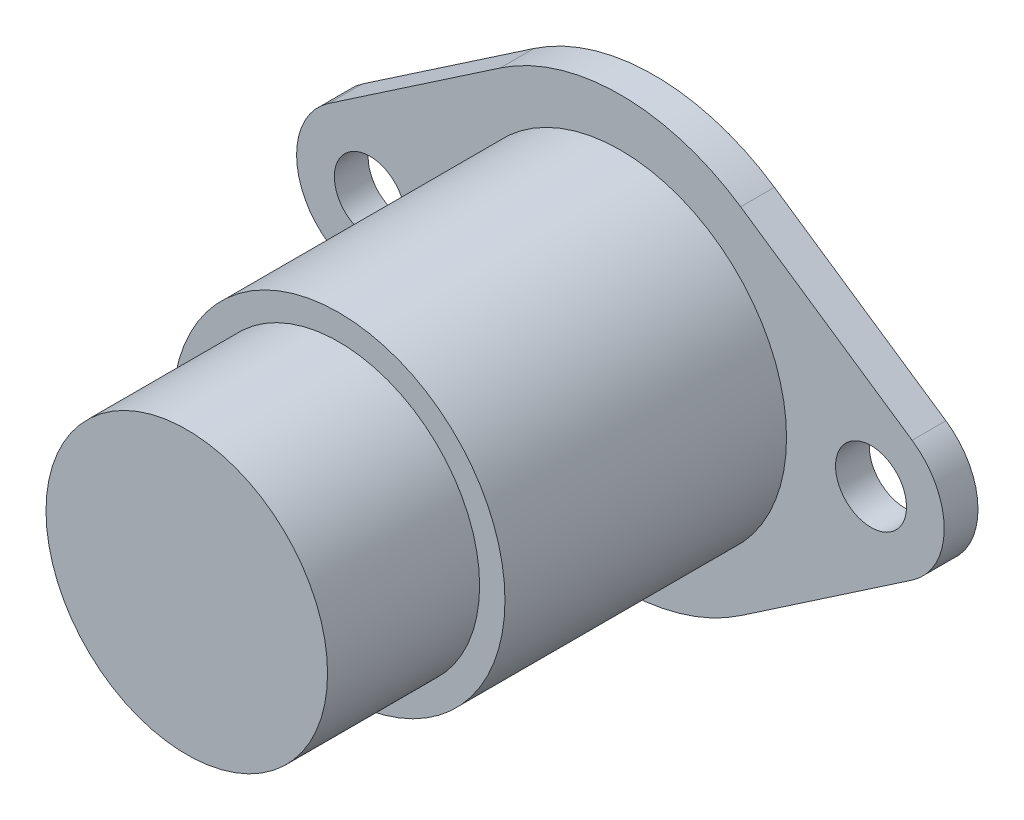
ISO-10303-21;
HEADER;
FILE_DESCRIPTION(('STEP AP214'),'2;1');
FILE_NAME('part.step','',(''),(''),'','','');
FILE_SCHEMA(('AUTOMOTIVE_DESIGN { 1 0 10303 214 1 1 1 1 }'));
ENDSEC;
DATA;
#1=APPLICATION_CONTEXT('core data for automotive mechanical design processes');
#2=APPLICATION_PROTOCOL_DEFINITION('international standard','automotive_design',2000,#1);
#3=PRODUCT_CONTEXT('',#1,'mechanical');
#4=PRODUCT('Part','Part','',(#3));
#5=PRODUCT_RELATED_PRODUCT_CATEGORY('part','',(#4));
#6=PRODUCT_DEFINITION_FORMATION('','',#4);
#7=PRODUCT_DEFINITION_CONTEXT('part definition',#1,'design');
#8=PRODUCT_DEFINITION('design','',#6,#7);
#9=PRODUCT_DEFINITION_SHAPE('','',#8);
#10=(LENGTH_UNIT() NAMED_UNIT(*) SI_UNIT(.MILLI.,.METRE.));
#11=(NAMED_UNIT(*) PLANE_ANGLE_UNIT() SI_UNIT($,.RADIAN.));
#12=(NAMED_UNIT(*) SI_UNIT($,.STERADIAN.) SOLID_ANGLE_UNIT());
#13=UNCERTAINTY_MEASURE_WITH_UNIT(LENGTH_MEASURE(1.E-05),#10,'distance_accuracy_value','');
#14=(GEOMETRIC_REPRESENTATION_CONTEXT(3) GLOBAL_UNCERTAINTY_ASSIGNED_CONTEXT((#13)) GLOBAL_UNIT_ASSIGNED_CONTEXT((#10,
#11,#12)) REPRESENTATION_CONTEXT('',''));
#15=CARTESIAN_POINT('',(0.,0.,0.));
#16=DIRECTION('',(0.,0.,1.));
#17=DIRECTION('',(1.,0.,0.));
#18=AXIS2_PLACEMENT_3D('',#15,#16,#17);
#19=CARTESIAN_POINT('',(0.,0.,21.082));
#20=DIRECTION('',(0.,0.,-1.));
#21=DIRECTION('',(-1.,0.,0.));
#22=AXIS2_PLACEMENT_3D('',#19,#20,#21);
#23=CYLINDRICAL_SURFACE('',#22,6.35);
#24=CARTESIAN_POINT('',(0.,0.,21.082));
#25=DIRECTION('',(0.,0.,1.));
#26=DIRECTION('',(1.,0.,0.));
#27=AXIS2_PLACEMENT_3D('',#24,#25,#26);
#28=CIRCLE('',#27,6.35);
#29=CARTESIAN_POINT('',(6.35,0.,21.082));
#30=VERTEX_POINT('',#29);
#31=EDGE_CURVE('E11',#30,#30,#28,.T.);
#32=ORIENTED_EDGE('',*,*,#31,.F.);
#33=EDGE_LOOP('',(#32));
#34=FACE_BOUND('',#33,.T.);
#35=CARTESIAN_POINT('',(0.,0.,14.224));
#36=DIRECTION('',(0.,0.,1.));
#37=DIRECTION('',(1.,0.,0.));
#38=AXIS2_PLACEMENT_3D('',#35,#36,#37);
#39=CIRCLE('',#38,6.35);
#40=CARTESIAN_POINT('',(6.35,0.,14.224));
#41=VERTEX_POINT('',#40);
#42=EDGE_CURVE('E43',#41,#41,#39,.T.);
#43=ORIENTED_EDGE('',*,*,#42,.T.);
#44=EDGE_LOOP('',(#43));
#45=FACE_BOUND('',#44,.T.);
#46=ADVANCED_FACE('F40',(#34,#45),#23,.T.);
#47=CARTESIAN_POINT('',(0.,0.,21.082));
#48=DIRECTION('',(0.,0.,1.));
#49=DIRECTION('',(1.,0.,0.));
#50=AXIS2_PLACEMENT_3D('',#47,#48,#49);
#51=PLANE('',#50);
#52=ORIENTED_EDGE('',*,*,#31,.T.);
#53=EDGE_LOOP('',(#52));
#54=FACE_BOUND('',#53,.T.);
#55=ADVANCED_FACE('F55',(#54),#51,.T.);
#56=CARTESIAN_POINT('',(0.,0.,14.224));
#57=DIRECTION('',(0.,0.,1.));
#58=DIRECTION('',(1.,0.,0.));
#59=AXIS2_PLACEMENT_3D('',#56,#57,#58);
#60=PLANE('',#59);
#61=ORIENTED_EDGE('',*,*,#42,.F.);
#62=EDGE_LOOP('',(#61));
#63=FACE_BOUND('',#62,.T.);
#64=ADVANCED_FACE('F53',(#63),#60,.F.);
#65=CLOSED_SHELL('',(#46,#55,#64));
#66=MANIFOLD_SOLID_BREP('B2',#65);
#67=CARTESIAN_POINT('',(0.,0.,0.254000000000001));
#68=DIRECTION('',(0.,0.,1.));
#69=DIRECTION('',(1.,0.,0.));
#70=AXIS2_PLACEMENT_3D('',#67,#68,#69);
#71=CYLINDRICAL_SURFACE('',#70,5.969);
#72=CARTESIAN_POINT('',(0.,0.,0.254000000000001));
#73=DIRECTION('',(0.,0.,-1.));
#74=DIRECTION('',(-1.,0.,0.));
#75=AXIS2_PLACEMENT_3D('',#72,#73,#74);
#76=CIRCLE('',#75,5.969);
#77=CARTESIAN_POINT('',(-5.969,0.,0.254000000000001));
#78=VERTEX_POINT('',#77);
#79=EDGE_CURVE('E39',#78,#78,#76,.T.);
#80=ORIENTED_EDGE('',*,*,#79,.F.);
#81=EDGE_LOOP('',(#80));
#82=FACE_BOUND('',#81,.T.);
#83=CARTESIAN_POINT('',(0.,0.,10.16));
#84=DIRECTION('',(0.,0.,-1.));
#85=DIRECTION('',(-1.,0.,0.));
#86=AXIS2_PLACEMENT_3D('',#83,#84,#85);
#87=CIRCLE('',#86,5.969);
#88=CARTESIAN_POINT('',(-5.969,0.,10.16));
#89=VERTEX_POINT('',#88);
#90=EDGE_CURVE('E92',#89,#89,#87,.T.);
#91=ORIENTED_EDGE('',*,*,#90,.T.);
#92=EDGE_LOOP('',(#91));
#93=FACE_BOUND('',#92,.T.);
#94=ADVANCED_FACE('F89',(#82,#93),#71,.T.);
#95=CARTESIAN_POINT('',(0.,0.,0.254000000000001));
#96=DIRECTION('',(0.,0.,-1.));
#97=DIRECTION('',(-1.,0.,0.));
#98=AXIS2_PLACEMENT_3D('',#95,#96,#97);
#99=PLANE('',#98);
#100=ORIENTED_EDGE('',*,*,#79,.T.);
#101=EDGE_LOOP('',(#100));
#102=FACE_BOUND('',#101,.T.);
#103=ADVANCED_FACE('F104',(#102),#99,.T.);
#104=CARTESIAN_POINT('',(0.,0.,10.16));
#105=DIRECTION('',(0.,0.,-1.));
#106=DIRECTION('',(-1.,0.,0.));
#107=AXIS2_PLACEMENT_3D('',#104,#105,#106);
#108=PLANE('',#107);
#109=ORIENTED_EDGE('',*,*,#90,.F.);
#110=EDGE_LOOP('',(#109));
#111=FACE_BOUND('',#110,.T.);
#112=ADVANCED_FACE('F102',(#111),#108,.F.);
#113=CLOSED_SHELL('',(#94,#103,#112));
#114=MANIFOLD_SOLID_BREP('B6',#113);
#115=CARTESIAN_POINT('',(0.,0.,1.524));
#116=DIRECTION('',(0.,0.,-1.));
#117=DIRECTION('',(-1.,0.,0.));
#118=AXIS2_PLACEMENT_3D('',#115,#116,#117);
#119=PLANE('',#118);
#120=CARTESIAN_POINT('',(11.303,0.,1.524));
#121=DIRECTION('',(0.,0.,1.));
#122=DIRECTION('',(1.,0.,0.));
#123=AXIS2_PLACEMENT_3D('',#120,#121,#122);
#124=CIRCLE('',#123,1.6002);
#125=CARTESIAN_POINT('',(12.9032,0.,1.524));
#126=VERTEX_POINT('',#125);
#127=EDGE_CURVE('E290',#126,#126,#124,.T.);
#128=ORIENTED_EDGE('',*,*,#127,.F.);
#129=EDGE_LOOP('',(#128));
#130=FACE_BOUND('',#129,.T.);
#131=CARTESIAN_POINT('',(-11.303,0.,1.524));
#132=DIRECTION('',(0.,0.,1.));
#133=DIRECTION('',(1.,0.,0.));
#134=AXIS2_PLACEMENT_3D('',#131,#132,#133);
#135=CIRCLE('',#134,1.6002);
#136=CARTESIAN_POINT('',(-9.7028,0.,1.524));
#137=VERTEX_POINT('',#136);
#138=EDGE_CURVE('E284',#137,#137,#135,.T.);
#139=ORIENTED_EDGE('',*,*,#138,.F.);
#140=EDGE_LOOP('',(#139));
#141=FACE_BOUND('',#140,.T.);
#142=CARTESIAN_POINT('',(0.,0.,1.524));
#143=DIRECTION('',(0.,0.,1.));
#144=DIRECTION('',(-1.,0.,0.));
#145=AXIS2_PLACEMENT_3D('',#142,#143,#144);
#146=CIRCLE('',#145,9.652);
#147=CARTESIAN_POINT('',(5.42247191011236,7.98485456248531,1.524));
#148=VERTEX_POINT('',#147);
#149=CARTESIAN_POINT('',(-5.42247191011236,7.9848545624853,1.524));
#150=VERTEX_POINT('',#149);
#151=EDGE_CURVE('E242',#148,#150,#146,.T.);
#152=ORIENTED_EDGE('',*,*,#151,.T.);
#153=DIRECTION('',(-0.827274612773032,-0.561797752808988,0.));
#154=VECTOR('',#153,1.);
#155=CARTESIAN_POINT('',(-5.42247191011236,7.9848545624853,1.524));
#156=LINE('',#155,#154);
#157=CARTESIAN_POINT('',(-13.1580561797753,2.73166077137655,1.524));
#158=VERTEX_POINT('',#157);
#159=EDGE_CURVE('E190',#150,#158,#156,.T.);
#160=ORIENTED_EDGE('',*,*,#159,.T.);
#161=CARTESIAN_POINT('',(-11.303,0.,1.524));
#162=DIRECTION('',(0.,0.,1.));
#163=DIRECTION('',(1.,0.,0.));
#164=AXIS2_PLACEMENT_3D('',#161,#162,#163);
#165=CIRCLE('',#164,3.302);
#166=CARTESIAN_POINT('',(-13.1580561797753,-2.73166077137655,1.524));
#167=VERTEX_POINT('',#166);
#168=EDGE_CURVE('E273',#158,#167,#165,.T.);
#169=ORIENTED_EDGE('',*,*,#168,.T.);
#170=DIRECTION('',(0.827274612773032,-0.561797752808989,0.));
#171=VECTOR('',#170,1.);
#172=CARTESIAN_POINT('',(-5.42247191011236,-7.98485456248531,1.524));
#173=LINE('',#172,#171);
#174=CARTESIAN_POINT('',(-5.42247191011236,-7.98485456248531,1.524));
#175=VERTEX_POINT('',#174);
#176=EDGE_CURVE('E272',#167,#175,#173,.T.);
#177=ORIENTED_EDGE('',*,*,#176,.T.);
#178=CARTESIAN_POINT('',(0.,0.,1.524));
#179=DIRECTION('',(0.,0.,1.));
#180=DIRECTION('',(-1.,0.,0.));
#181=AXIS2_PLACEMENT_3D('',#178,#179,#180);
#182=CIRCLE('',#181,9.652);
#183=CARTESIAN_POINT('',(5.42247191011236,-7.9848545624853,1.524));
#184=VERTEX_POINT('',#183);
#185=EDGE_CURVE('E209',#175,#184,#182,.T.);
#186=ORIENTED_EDGE('',*,*,#185,.T.);
#187=DIRECTION('',(0.827274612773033,0.561797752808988,0.));
#188=VECTOR('',#187,1.);
#189=CARTESIAN_POINT('',(5.42247191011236,-7.9848545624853,1.524));
#190=LINE('',#189,#188);
#191=CARTESIAN_POINT('',(13.1580561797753,-2.73166077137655,1.524));
#192=VERTEX_POINT('',#191);
#193=EDGE_CURVE('E203',#184,#192,#190,.T.);
#194=ORIENTED_EDGE('',*,*,#193,.T.);
#195=CARTESIAN_POINT('',(11.303,0.,1.524));
#196=DIRECTION('',(0.,0.,1.));
#197=DIRECTION('',(1.,0.,0.));
#198=AXIS2_PLACEMENT_3D('',#195,#196,#197);
#199=CIRCLE('',#198,3.302);
#200=CARTESIAN_POINT('',(13.1580561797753,2.73166077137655,1.524));
#201=VERTEX_POINT('',#200);
#202=EDGE_CURVE('E207',#192,#201,#199,.T.);
#203=ORIENTED_EDGE('',*,*,#202,.T.);
#204=DIRECTION('',(-0.827274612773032,0.561797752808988,0.));
#205=VECTOR('',#204,1.);
#206=CARTESIAN_POINT('',(5.42247191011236,7.98485456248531,1.524));
#207=LINE('',#206,#205);
#208=EDGE_CURVE('E146',#201,#148,#207,.T.);
#209=ORIENTED_EDGE('',*,*,#208,.T.);
#210=EDGE_LOOP('',(#152,#160,#169,#177,#186,#194,#203,#209));
#211=FACE_BOUND('',#210,.T.);
#212=CARTESIAN_POINT('',(0.,0.,1.524));
#213=DIRECTION('',(0.,0.,-1.));
#214=DIRECTION('',(-1.,0.,0.));
#215=AXIS2_PLACEMENT_3D('',#212,#213,#214);
#216=CIRCLE('',#215,7.493);
#217=CARTESIAN_POINT('',(-7.493,0.,1.524));
#218=VERTEX_POINT('',#217);
#219=EDGE_CURVE('E87',#218,#218,#216,.F.);
#220=ORIENTED_EDGE('',*,*,#219,.F.);
#221=EDGE_LOOP('',(#220));
#222=FACE_BOUND('',#221,.T.);
#223=ADVANCED_FACE('F129',(#130,#141,#211,#222),#119,.F.);
#224=CARTESIAN_POINT('',(0.,0.,1.524));
#225=DIRECTION('',(0.,0.,-1.));
#226=DIRECTION('',(-1.,0.,0.));
#227=AXIS2_PLACEMENT_3D('',#224,#225,#226);
#228=CYLINDRICAL_SURFACE('',#227,9.652);
#229=CARTESIAN_POINT('',(0.,0.,0.));
#230=DIRECTION('',(0.,0.,1.));
#231=DIRECTION('',(-1.,0.,0.));
#232=AXIS2_PLACEMENT_3D('',#229,#230,#231);
#233=CIRCLE('',#232,9.652);
#234=CARTESIAN_POINT('',(5.42247191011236,7.98485456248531,0.));
#235=VERTEX_POINT('',#234);
#236=CARTESIAN_POINT('',(-5.42247191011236,7.9848545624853,0.));
#237=VERTEX_POINT('',#236);
#238=EDGE_CURVE('E227',#235,#237,#233,.T.);
#239=ORIENTED_EDGE('',*,*,#238,.T.);
#240=DIRECTION('',(0.,0.,-1.));
#241=VECTOR('',#240,1.);
#242=CARTESIAN_POINT('',(-5.42247191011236,7.9848545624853,1.524));
#243=LINE('',#242,#241);
#244=EDGE_CURVE('E138',#150,#237,#243,.T.);
#245=ORIENTED_EDGE('',*,*,#244,.F.);
#246=ORIENTED_EDGE('',*,*,#151,.F.);
#247=DIRECTION('',(0.,0.,-1.));
#248=VECTOR('',#247,1.);
#249=CARTESIAN_POINT('',(5.42247191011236,7.98485456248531,1.524));
#250=LINE('',#249,#248);
#251=EDGE_CURVE('E223',#148,#235,#250,.T.);
#252=ORIENTED_EDGE('',*,*,#251,.T.);
#253=EDGE_LOOP('',(#239,#245,#246,#252));
#254=FACE_BOUND('',#253,.T.);
#255=ADVANCED_FACE('F131',(#254),#228,.T.);
#256=CARTESIAN_POINT('',(-5.42247191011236,7.9848545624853,1.524));
#257=DIRECTION('',(0.561797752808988,-0.827274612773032,0.));
#258=DIRECTION('',(0.827274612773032,0.561797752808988,0.));
#259=AXIS2_PLACEMENT_3D('',#256,#257,#258);
#260=PLANE('',#259);
#261=DIRECTION('',(-0.827274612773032,-0.561797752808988,0.));
#262=VECTOR('',#261,1.);
#263=CARTESIAN_POINT('',(-5.42247191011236,7.9848545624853,0.));
#264=LINE('',#263,#262);
#265=CARTESIAN_POINT('',(-13.1580561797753,2.73166077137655,0.));
#266=VERTEX_POINT('',#265);
#267=EDGE_CURVE('E230',#237,#266,#264,.T.);
#268=ORIENTED_EDGE('',*,*,#267,.T.);
#269=DIRECTION('',(0.,0.,-1.));
#270=VECTOR('',#269,1.);
#271=CARTESIAN_POINT('',(-13.1580561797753,2.73166077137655,1.524));
#272=LINE('',#271,#270);
#273=EDGE_CURVE('E252',#158,#266,#272,.T.);
#274=ORIENTED_EDGE('',*,*,#273,.F.);
#275=ORIENTED_EDGE('',*,*,#159,.F.);
#276=ORIENTED_EDGE('',*,*,#244,.T.);
#277=EDGE_LOOP('',(#268,#274,#275,#276));
#278=FACE_BOUND('',#277,.T.);
#279=ADVANCED_FACE('F255',(#278),#260,.F.);
#280=CARTESIAN_POINT('',(-11.303,0.,1.524));
#281=DIRECTION('',(0.,0.,-1.));
#282=DIRECTION('',(-1.,0.,0.));
#283=AXIS2_PLACEMENT_3D('',#280,#281,#282);
#284=CYLINDRICAL_SURFACE('',#283,3.302);
#285=CARTESIAN_POINT('',(-11.303,0.,0.));
#286=DIRECTION('',(0.,0.,1.));
#287=DIRECTION('',(1.,0.,0.));
#288=AXIS2_PLACEMENT_3D('',#285,#286,#287);
#289=CIRCLE('',#288,3.302);
#290=CARTESIAN_POINT('',(-13.1580561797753,-2.73166077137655,0.));
#291=VERTEX_POINT('',#290);
#292=EDGE_CURVE('E233',#266,#291,#289,.T.);
#293=ORIENTED_EDGE('',*,*,#292,.T.);
#294=DIRECTION('',(0.,0.,-1.));
#295=VECTOR('',#294,1.);
#296=CARTESIAN_POINT('',(-13.1580561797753,-2.73166077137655,1.524));
#297=LINE('',#296,#295);
#298=EDGE_CURVE('E249',#167,#291,#297,.T.);
#299=ORIENTED_EDGE('',*,*,#298,.F.);
#300=ORIENTED_EDGE('',*,*,#168,.F.);
#301=ORIENTED_EDGE('',*,*,#273,.T.);
#302=EDGE_LOOP('',(#293,#299,#300,#301));
#303=FACE_BOUND('',#302,.T.);
#304=ADVANCED_FACE('F266',(#303),#284,.T.);
#305=CARTESIAN_POINT('',(-5.42247191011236,-7.98485456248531,1.524));
#306=DIRECTION('',(0.561797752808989,0.827274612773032,0.));
#307=DIRECTION('',(-0.827274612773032,0.561797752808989,0.));
#308=AXIS2_PLACEMENT_3D('',#305,#306,#307);
#309=PLANE('',#308);
#310=DIRECTION('',(0.827274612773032,-0.561797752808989,0.));
#311=VECTOR('',#310,1.);
#312=CARTESIAN_POINT('',(-5.42247191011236,-7.98485456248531,0.));
#313=LINE('',#312,#311);
#314=CARTESIAN_POINT('',(-5.42247191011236,-7.98485456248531,0.));
#315=VERTEX_POINT('',#314);
#316=EDGE_CURVE('E235',#291,#315,#313,.T.);
#317=ORIENTED_EDGE('',*,*,#316,.T.);
#318=DIRECTION('',(0.,0.,-1.));
#319=VECTOR('',#318,1.);
#320=CARTESIAN_POINT('',(-5.42247191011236,-7.98485456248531,1.524));
#321=LINE('',#320,#319);
#322=EDGE_CURVE('E246',#175,#315,#321,.T.);
#323=ORIENTED_EDGE('',*,*,#322,.F.);
#324=ORIENTED_EDGE('',*,*,#176,.F.);
#325=ORIENTED_EDGE('',*,*,#298,.T.);
#326=EDGE_LOOP('',(#317,#323,#324,#325));
#327=FACE_BOUND('',#326,.T.);
#328=ADVANCED_FACE('F270',(#327),#309,.F.);
#329=CARTESIAN_POINT('',(0.,0.,1.524));
#330=DIRECTION('',(0.,0.,-1.));
#331=DIRECTION('',(-1.,0.,0.));
#332=AXIS2_PLACEMENT_3D('',#329,#330,#331);
#333=CYLINDRICAL_SURFACE('',#332,9.652);
#334=CARTESIAN_POINT('',(0.,0.,0.));
#335=DIRECTION('',(0.,0.,1.));
#336=DIRECTION('',(-1.,0.,0.));
#337=AXIS2_PLACEMENT_3D('',#334,#335,#336);
#338=CIRCLE('',#337,9.652);
#339=CARTESIAN_POINT('',(5.42247191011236,-7.9848545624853,0.));
#340=VERTEX_POINT('',#339);
#341=EDGE_CURVE('E237',#315,#340,#338,.T.);
#342=ORIENTED_EDGE('',*,*,#341,.T.);
#343=DIRECTION('',(0.,0.,-1.));
#344=VECTOR('',#343,1.);
#345=CARTESIAN_POINT('',(5.42247191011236,-7.9848545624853,1.524));
#346=LINE('',#345,#344);
#347=EDGE_CURVE('E218',#184,#340,#346,.T.);
#348=ORIENTED_EDGE('',*,*,#347,.F.);
#349=ORIENTED_EDGE('',*,*,#185,.F.);
#350=ORIENTED_EDGE('',*,*,#322,.T.);
#351=EDGE_LOOP('',(#342,#348,#349,#350));
#352=FACE_BOUND('',#351,.T.);
#353=ADVANCED_FACE('F347',(#352),#333,.T.);
#354=CARTESIAN_POINT('',(5.42247191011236,-7.9848545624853,1.524));
#355=DIRECTION('',(-0.561797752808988,0.827274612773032,0.));
#356=DIRECTION('',(-0.827274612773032,-0.561797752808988,0.));
#357=AXIS2_PLACEMENT_3D('',#354,#355,#356);
#358=PLANE('',#357);
#359=DIRECTION('',(0.827274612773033,0.561797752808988,0.));
#360=VECTOR('',#359,1.);
#361=CARTESIAN_POINT('',(5.42247191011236,-7.9848545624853,0.));
#362=LINE('',#361,#360);
#363=CARTESIAN_POINT('',(13.1580561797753,-2.73166077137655,0.));
#364=VERTEX_POINT('',#363);
#365=EDGE_CURVE('E217',#340,#364,#362,.T.);
#366=ORIENTED_EDGE('',*,*,#365,.T.);
#367=DIRECTION('',(0.,0.,-1.));
#368=VECTOR('',#367,1.);
#369=CARTESIAN_POINT('',(13.1580561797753,-2.73166077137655,1.524));
#370=LINE('',#369,#368);
#371=EDGE_CURVE('E214',#192,#364,#370,.T.);
#372=ORIENTED_EDGE('',*,*,#371,.F.);
#373=ORIENTED_EDGE('',*,*,#193,.F.);
#374=ORIENTED_EDGE('',*,*,#347,.T.);
#375=EDGE_LOOP('',(#366,#372,#373,#374));
#376=FACE_BOUND('',#375,.T.);
#377=ADVANCED_FACE('F215',(#376),#358,.F.);
#378=CARTESIAN_POINT('',(11.303,0.,1.524));
#379=DIRECTION('',(0.,0.,-1.));
#380=DIRECTION('',(-1.,0.,0.));
#381=AXIS2_PLACEMENT_3D('',#378,#379,#380);
#382=CYLINDRICAL_SURFACE('',#381,3.302);
#383=CARTESIAN_POINT('',(11.303,0.,0.));
#384=DIRECTION('',(0.,0.,1.));
#385=DIRECTION('',(1.,0.,0.));
#386=AXIS2_PLACEMENT_3D('',#383,#384,#385);
#387=CIRCLE('',#386,3.302);
#388=CARTESIAN_POINT('',(13.1580561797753,2.73166077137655,0.));
#389=VERTEX_POINT('',#388);
#390=EDGE_CURVE('E175',#364,#389,#387,.T.);
#391=ORIENTED_EDGE('',*,*,#390,.T.);
#392=DIRECTION('',(0.,0.,-1.));
#393=VECTOR('',#392,1.);
#394=CARTESIAN_POINT('',(13.1580561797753,2.73166077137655,1.524));
#395=LINE('',#394,#393);
#396=EDGE_CURVE('E219',#201,#389,#395,.T.);
#397=ORIENTED_EDGE('',*,*,#396,.F.);
#398=ORIENTED_EDGE('',*,*,#202,.F.);
#399=ORIENTED_EDGE('',*,*,#371,.T.);
#400=EDGE_LOOP('',(#391,#397,#398,#399));
#401=FACE_BOUND('',#400,.T.);
#402=ADVANCED_FACE('F221',(#401),#382,.T.);
#403=CARTESIAN_POINT('',(5.42247191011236,7.98485456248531,1.524));
#404=DIRECTION('',(-0.561797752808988,-0.827274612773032,0.));
#405=DIRECTION('',(0.827274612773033,-0.561797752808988,0.));
#406=AXIS2_PLACEMENT_3D('',#403,#404,#405);
#407=PLANE('',#406);
#408=DIRECTION('',(-0.827274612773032,0.561797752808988,0.));
#409=VECTOR('',#408,1.);
#410=CARTESIAN_POINT('',(5.42247191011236,7.98485456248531,0.));
#411=LINE('',#410,#409);
#412=EDGE_CURVE('E181',#389,#235,#411,.T.);
#413=ORIENTED_EDGE('',*,*,#412,.T.);
#414=ORIENTED_EDGE('',*,*,#251,.F.);
#415=ORIENTED_EDGE('',*,*,#208,.F.);
#416=ORIENTED_EDGE('',*,*,#396,.T.);
#417=EDGE_LOOP('',(#413,#414,#415,#416));
#418=FACE_BOUND('',#417,.T.);
#419=ADVANCED_FACE('F312',(#418),#407,.F.);
#420=CARTESIAN_POINT('',(0.,0.,0.));
#421=DIRECTION('',(0.,0.,-1.));
#422=DIRECTION('',(-1.,0.,0.));
#423=AXIS2_PLACEMENT_3D('',#420,#421,#422);
#424=PLANE('',#423);
#425=CARTESIAN_POINT('',(0.,0.,0.));
#426=DIRECTION('',(0.,0.,-1.));
#427=DIRECTION('',(-1.,0.,0.));
#428=AXIS2_PLACEMENT_3D('',#425,#426,#427);
#429=CIRCLE('',#428,6.985);
#430=CARTESIAN_POINT('',(-6.985,0.,0.));
#431=VERTEX_POINT('',#430);
#432=EDGE_CURVE('E294',#431,#431,#429,.T.);
#433=ORIENTED_EDGE('',*,*,#432,.F.);
#434=EDGE_LOOP('',(#433));
#435=FACE_BOUND('',#434,.T.);
#436=CARTESIAN_POINT('',(11.303,0.,0.));
#437=DIRECTION('',(0.,0.,-1.));
#438=DIRECTION('',(-1.,0.,0.));
#439=AXIS2_PLACEMENT_3D('',#436,#437,#438);
#440=CIRCLE('',#439,1.6002);
#441=CARTESIAN_POINT('',(9.7028,0.,0.));
#442=VERTEX_POINT('',#441);
#443=EDGE_CURVE('E287',#442,#442,#440,.F.);
#444=ORIENTED_EDGE('',*,*,#443,.T.);
#445=EDGE_LOOP('',(#444));
#446=FACE_BOUND('',#445,.T.);
#447=CARTESIAN_POINT('',(-11.303,0.,0.));
#448=DIRECTION('',(0.,0.,-1.));
#449=DIRECTION('',(-1.,0.,0.));
#450=AXIS2_PLACEMENT_3D('',#447,#448,#449);
#451=CIRCLE('',#450,1.6002);
#452=CARTESIAN_POINT('',(-12.9032,0.,0.));
#453=VERTEX_POINT('',#452);
#454=EDGE_CURVE('E281',#453,#453,#451,.F.);
#455=ORIENTED_EDGE('',*,*,#454,.T.);
#456=EDGE_LOOP('',(#455));
#457=FACE_BOUND('',#456,.T.);
#458=ORIENTED_EDGE('',*,*,#238,.F.);
#459=ORIENTED_EDGE('',*,*,#412,.F.);
#460=ORIENTED_EDGE('',*,*,#390,.F.);
#461=ORIENTED_EDGE('',*,*,#365,.F.);
#462=ORIENTED_EDGE('',*,*,#341,.F.);
#463=ORIENTED_EDGE('',*,*,#316,.F.);
#464=ORIENTED_EDGE('',*,*,#292,.F.);
#465=ORIENTED_EDGE('',*,*,#267,.F.);
#466=EDGE_LOOP('',(#458,#459,#460,#461,#462,#463,#464,#465));
#467=FACE_BOUND('',#466,.T.);
#468=ADVANCED_FACE('F260',(#435,#446,#457,#467),#424,.T.);
#469=CARTESIAN_POINT('',(0.,0.,14.224));
#470=DIRECTION('',(0.,0.,-1.));
#471=DIRECTION('',(-1.,0.,0.));
#472=AXIS2_PLACEMENT_3D('',#469,#470,#471);
#473=CYLINDRICAL_SURFACE('',#472,7.493);
#474=CARTESIAN_POINT('',(0.,0.,14.224));
#475=DIRECTION('',(0.,0.,1.));
#476=DIRECTION('',(1.,0.,0.));
#477=AXIS2_PLACEMENT_3D('',#474,#475,#476);
#478=CIRCLE('',#477,7.493);
#479=CARTESIAN_POINT('',(7.493,0.,14.224));
#480=VERTEX_POINT('',#479);
#481=EDGE_CURVE('E231',#480,#480,#478,.T.);
#482=ORIENTED_EDGE('',*,*,#481,.F.);
#483=EDGE_LOOP('',(#482));
#484=FACE_BOUND('',#483,.T.);
#485=ORIENTED_EDGE('',*,*,#219,.T.);
#486=EDGE_LOOP('',(#485));
#487=FACE_BOUND('',#486,.T.);
#488=ADVANCED_FACE('F311',(#484,#487),#473,.T.);
#489=CARTESIAN_POINT('',(0.,0.,14.224));
#490=DIRECTION('',(0.,0.,1.));
#491=DIRECTION('',(1.,0.,0.));
#492=AXIS2_PLACEMENT_3D('',#489,#490,#491);
#493=PLANE('',#492);
#494=ORIENTED_EDGE('',*,*,#481,.T.);
#495=EDGE_LOOP('',(#494));
#496=FACE_BOUND('',#495,.T.);
#497=ADVANCED_FACE('F320',(#496),#493,.T.);
#498=CARTESIAN_POINT('',(-11.303,0.,-4.52604908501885));
#499=DIRECTION('',(0.,0.,1.));
#500=DIRECTION('',(1.,0.,0.));
#501=AXIS2_PLACEMENT_3D('',#498,#499,#500);
#502=CYLINDRICAL_SURFACE('',#501,1.6002);
#503=ORIENTED_EDGE('',*,*,#138,.T.);
#504=EDGE_LOOP('',(#503));
#505=FACE_BOUND('',#504,.T.);
#506=ORIENTED_EDGE('',*,*,#454,.F.);
#507=EDGE_LOOP('',(#506));
#508=FACE_BOUND('',#507,.T.);
#509=ADVANCED_FACE('F318',(#505,#508),#502,.F.);
#510=CARTESIAN_POINT('',(11.303,0.,-4.52604908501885));
#511=DIRECTION('',(0.,0.,1.));
#512=DIRECTION('',(1.,0.,0.));
#513=AXIS2_PLACEMENT_3D('',#510,#511,#512);
#514=CYLINDRICAL_SURFACE('',#513,1.6002);
#515=ORIENTED_EDGE('',*,*,#127,.T.);
#516=EDGE_LOOP('',(#515));
#517=FACE_BOUND('',#516,.T.);
#518=ORIENTED_EDGE('',*,*,#443,.F.);
#519=EDGE_LOOP('',(#518));
#520=FACE_BOUND('',#519,.T.);
#521=ADVANCED_FACE('F305',(#517,#520),#514,.F.);
#522=CARTESIAN_POINT('',(0.,0.,10.16));
#523=DIRECTION('',(0.,0.,-1.));
#524=DIRECTION('',(-1.,0.,0.));
#525=AXIS2_PLACEMENT_3D('',#522,#523,#524);
#526=CYLINDRICAL_SURFACE('',#525,6.985);
#527=CARTESIAN_POINT('',(0.,0.,10.16));
#528=DIRECTION('',(0.,0.,-1.));
#529=DIRECTION('',(-1.,0.,0.));
#530=AXIS2_PLACEMENT_3D('',#527,#528,#529);
#531=CIRCLE('',#530,6.985);
#532=CARTESIAN_POINT('',(-6.985,0.,10.16));
#533=VERTEX_POINT('',#532);
#534=EDGE_CURVE('E293',#533,#533,#531,.T.);
#535=ORIENTED_EDGE('',*,*,#534,.F.);
#536=EDGE_LOOP('',(#535));
#537=FACE_BOUND('',#536,.T.);
#538=ORIENTED_EDGE('',*,*,#432,.T.);
#539=EDGE_LOOP('',(#538));
#540=FACE_BOUND('',#539,.T.);
#541=ADVANCED_FACE('F302',(#537,#540),#526,.F.);
#542=CARTESIAN_POINT('',(0.,0.,10.16));
#543=DIRECTION('',(0.,0.,-1.));
#544=DIRECTION('',(-1.,0.,0.));
#545=AXIS2_PLACEMENT_3D('',#542,#543,#544);
#546=PLANE('',#545);
#547=ORIENTED_EDGE('',*,*,#534,.T.);
#548=EDGE_LOOP('',(#547));
#549=FACE_BOUND('',#548,.T.);
#550=ADVANCED_FACE('F300',(#549),#546,.T.);
#551=CLOSED_SHELL('',(#223,#255,#279,#304,#328,#353,#377,#402,#419,#468,#488,#497,#509,#521,
#541,#550));
#552=MANIFOLD_SOLID_BREP('B34',#551);
#553=ADVANCED_BREP_SHAPE_REPRESENTATION('',(#18,#66,#114,#552),#14);
#554=SHAPE_DEFINITION_REPRESENTATION(#9,#553);
ENDSEC;
END-ISO-10303-21;
